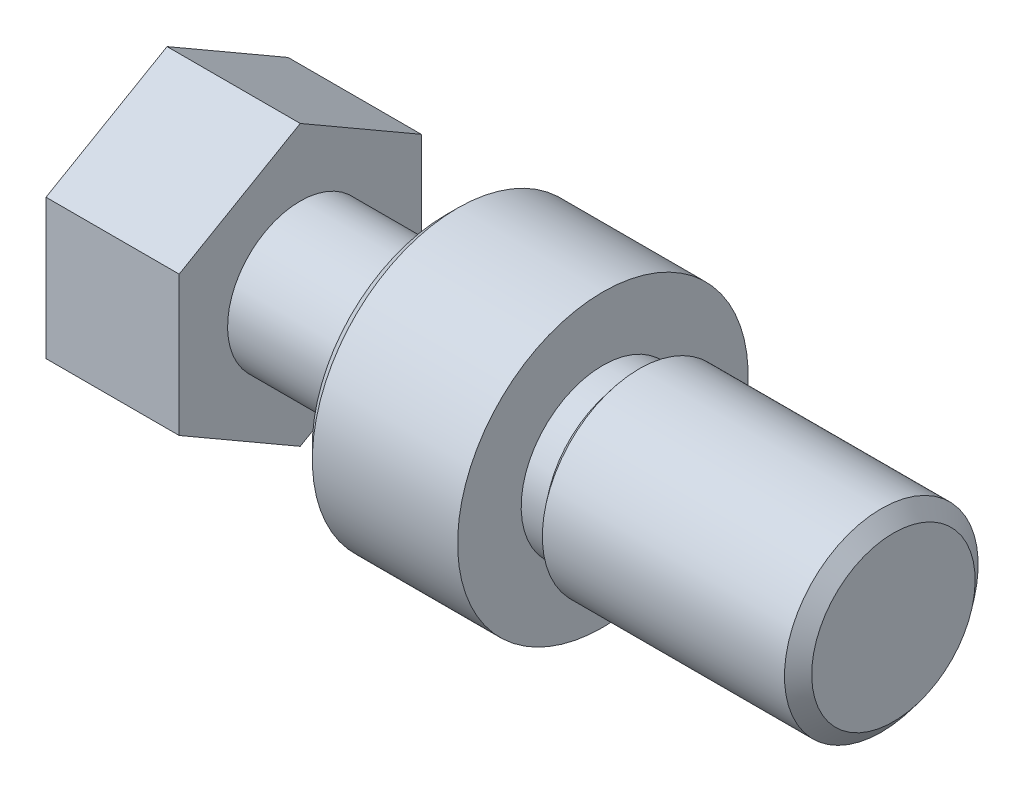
ISO-10303-21;
HEADER;
FILE_DESCRIPTION(('STEP AP214'),'2;1');
FILE_NAME('part.step','',(''),(''),'','','');
FILE_SCHEMA(('AUTOMOTIVE_DESIGN { 1 0 10303 214 1 1 1 1 }'));
ENDSEC;
DATA;
#1=APPLICATION_CONTEXT('core data for automotive mechanical design processes');
#2=APPLICATION_PROTOCOL_DEFINITION('international standard','automotive_design',2000,#1);
#3=PRODUCT_CONTEXT('',#1,'mechanical');
#4=PRODUCT('Part','Part','',(#3));
#5=PRODUCT_RELATED_PRODUCT_CATEGORY('part','',(#4));
#6=PRODUCT_DEFINITION_FORMATION('','',#4);
#7=PRODUCT_DEFINITION_CONTEXT('part definition',#1,'design');
#8=PRODUCT_DEFINITION('design','',#6,#7);
#9=PRODUCT_DEFINITION_SHAPE('','',#8);
#10=(LENGTH_UNIT() NAMED_UNIT(*) SI_UNIT(.MILLI.,.METRE.));
#11=(NAMED_UNIT(*) PLANE_ANGLE_UNIT() SI_UNIT($,.RADIAN.));
#12=(NAMED_UNIT(*) SI_UNIT($,.STERADIAN.) SOLID_ANGLE_UNIT());
#13=UNCERTAINTY_MEASURE_WITH_UNIT(LENGTH_MEASURE(1.E-05),#10,'distance_accuracy_value','');
#14=(GEOMETRIC_REPRESENTATION_CONTEXT(3) GLOBAL_UNCERTAINTY_ASSIGNED_CONTEXT((#13)) GLOBAL_UNIT_ASSIGNED_CONTEXT((#10,
#11,#12)) REPRESENTATION_CONTEXT('',''));
#15=CARTESIAN_POINT('',(0.,0.,0.));
#16=DIRECTION('',(0.,0.,1.));
#17=DIRECTION('',(1.,0.,0.));
#18=AXIS2_PLACEMENT_3D('',#15,#16,#17);
#19=CARTESIAN_POINT('',(-49.,1.6875,0.));
#20=DIRECTION('',(1.,0.,0.));
#21=DIRECTION('',(0.,0.,-1.));
#22=AXIS2_PLACEMENT_3D('',#19,#20,#21);
#23=PLANE('',#22);
#24=CARTESIAN_POINT('',(-49.,0.,0.));
#25=DIRECTION('',(1.,0.,0.));
#26=DIRECTION('',(0.,1.,0.));
#27=AXIS2_PLACEMENT_3D('',#24,#25,#26);
#28=CIRCLE('',#27,3.375);
#29=CARTESIAN_POINT('',(-49.,3.375,0.));
#30=VERTEX_POINT('',#29);
#31=EDGE_CURVE('E9',#30,#30,#28,.T.);
#32=ORIENTED_EDGE('',*,*,#31,.T.);
#33=EDGE_LOOP('',(#32));
#34=FACE_BOUND('',#33,.T.);
#35=ADVANCED_FACE('F14',(#34),#23,.T.);
#36=DIRECTION('',(0.624695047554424,-0.780868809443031,0.));
#37=VECTOR('',#36,1.);
#38=CARTESIAN_POINT('',(-399246.3,499000.,1.21002304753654E-13));
#39=LINE('',#38,#37);
#40=CARTESIAN_POINT('',(-46.3,0.,0.));
#41=DIRECTION('',(-1.,0.,0.));
#42=AXIS1_PLACEMENT('',#40,#41);
#43=SURFACE_OF_REVOLUTION('',#39,#42);
#44=CARTESIAN_POINT('',(-49.5,0.,0.));
#45=DIRECTION('',(1.,0.,0.));
#46=DIRECTION('',(0.,1.,0.));
#47=AXIS2_PLACEMENT_3D('',#44,#45,#46);
#48=CIRCLE('',#47,4.);
#49=CARTESIAN_POINT('',(-49.5,4.,0.));
#50=VERTEX_POINT('',#49);
#51=EDGE_CURVE('E388',#50,#50,#48,.T.);
#52=ORIENTED_EDGE('',*,*,#51,.T.);
#53=EDGE_LOOP('',(#52));
#54=FACE_BOUND('',#53,.T.);
#55=ORIENTED_EDGE('',*,*,#31,.F.);
#56=EDGE_LOOP('',(#55));
#57=FACE_BOUND('',#56,.T.);
#58=ADVANCED_FACE('F130',(#54,#57),#43,.F.);
#59=CARTESIAN_POINT('',(-54.5,0.,0.));
#60=DIRECTION('',(-1.,0.,0.));
#61=DIRECTION('',(0.,0.,1.));
#62=AXIS2_PLACEMENT_3D('',#59,#60,#61);
#63=CYLINDRICAL_SURFACE('',#62,4.);
#64=CARTESIAN_POINT('',(-59.5,0.,0.));
#65=DIRECTION('',(1.,0.,0.));
#66=DIRECTION('',(0.,1.,0.));
#67=AXIS2_PLACEMENT_3D('',#64,#65,#66);
#68=CIRCLE('',#67,4.);
#69=CARTESIAN_POINT('',(-59.5,4.,0.));
#70=VERTEX_POINT('',#69);
#71=EDGE_CURVE('E25',#70,#70,#68,.T.);
#72=ORIENTED_EDGE('',*,*,#71,.T.);
#73=EDGE_LOOP('',(#72));
#74=FACE_BOUND('',#73,.T.);
#75=ORIENTED_EDGE('',*,*,#51,.F.);
#76=EDGE_LOOP('',(#75));
#77=FACE_BOUND('',#76,.T.);
#78=ADVANCED_FACE('F134',(#74,#77),#63,.T.);
#79=DIRECTION('',(-0.624695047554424,-0.780868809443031,0.));
#80=VECTOR('',#79,1.);
#81=CARTESIAN_POINT('',(399137.3,499000.,1.21002304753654E-13));
#82=LINE('',#81,#80);
#83=CARTESIAN_POINT('',(-62.7000000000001,0.,0.));
#84=DIRECTION('',(1.,0.,0.));
#85=AXIS1_PLACEMENT('',#83,#84);
#86=SURFACE_OF_REVOLUTION('',#82,#85);
#87=CARTESIAN_POINT('',(-59.9999999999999,0.,0.));
#88=DIRECTION('',(1.,0.,0.));
#89=DIRECTION('',(0.,1.,0.));
#90=AXIS2_PLACEMENT_3D('',#87,#88,#89);
#91=CIRCLE('',#90,3.375);
#92=CARTESIAN_POINT('',(-59.9999999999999,3.375,0.));
#93=VERTEX_POINT('',#92);
#94=EDGE_CURVE('E368',#93,#93,#91,.T.);
#95=ORIENTED_EDGE('',*,*,#94,.T.);
#96=EDGE_LOOP('',(#95));
#97=FACE_BOUND('',#96,.T.);
#98=ORIENTED_EDGE('',*,*,#71,.F.);
#99=EDGE_LOOP('',(#98));
#100=FACE_BOUND('',#99,.T.);
#101=ADVANCED_FACE('F138',(#97,#100),#86,.F.);
#102=CARTESIAN_POINT('',(-60.5,0.,0.));
#103=DIRECTION('',(-1.,0.,0.));
#104=DIRECTION('',(0.,0.,1.));
#105=AXIS2_PLACEMENT_3D('',#102,#103,#104);
#106=CYLINDRICAL_SURFACE('',#105,3.375);
#107=CARTESIAN_POINT('',(-61.0000000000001,0.,0.));
#108=DIRECTION('',(1.,0.,0.));
#109=DIRECTION('',(0.,1.,0.));
#110=AXIS2_PLACEMENT_3D('',#107,#108,#109);
#111=CIRCLE('',#110,3.375);
#112=CARTESIAN_POINT('',(-61.0000000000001,3.375,0.));
#113=VERTEX_POINT('',#112);
#114=EDGE_CURVE('E373',#113,#113,#111,.T.);
#115=ORIENTED_EDGE('',*,*,#114,.T.);
#116=EDGE_LOOP('',(#115));
#117=FACE_BOUND('',#116,.T.);
#118=ORIENTED_EDGE('',*,*,#94,.F.);
#119=EDGE_LOOP('',(#118));
#120=FACE_BOUND('',#119,.T.);
#121=ADVANCED_FACE('F142',(#117,#120),#106,.T.);
#122=CARTESIAN_POINT('',(-61.0000000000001,4.6875,0.));
#123=DIRECTION('',(1.,0.,0.));
#124=DIRECTION('',(0.,0.,-1.));
#125=AXIS2_PLACEMENT_3D('',#122,#123,#124);
#126=PLANE('',#125);
#127=CARTESIAN_POINT('',(-61.0000000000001,0.,0.));
#128=DIRECTION('',(1.,0.,0.));
#129=DIRECTION('',(0.,1.,0.));
#130=AXIS2_PLACEMENT_3D('',#127,#128,#129);
#131=CIRCLE('',#130,6.);
#132=CARTESIAN_POINT('',(-61.0000000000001,6.00000000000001,0.));
#133=VERTEX_POINT('',#132);
#134=EDGE_CURVE('E378',#133,#133,#131,.T.);
#135=ORIENTED_EDGE('',*,*,#134,.T.);
#136=EDGE_LOOP('',(#135));
#137=FACE_BOUND('',#136,.T.);
#138=ORIENTED_EDGE('',*,*,#114,.F.);
#139=EDGE_LOOP('',(#138));
#140=FACE_BOUND('',#139,.T.);
#141=ADVANCED_FACE('F146',(#137,#140),#126,.T.);
#142=CARTESIAN_POINT('',(-63.9999999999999,0.,0.));
#143=DIRECTION('',(-1.,0.,0.));
#144=DIRECTION('',(0.,0.,1.));
#145=AXIS2_PLACEMENT_3D('',#142,#143,#144);
#146=CYLINDRICAL_SURFACE('',#145,6.);
#147=CARTESIAN_POINT('',(-67.0000000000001,0.,0.));
#148=DIRECTION('',(1.,0.,0.));
#149=DIRECTION('',(0.,1.,0.));
#150=AXIS2_PLACEMENT_3D('',#147,#148,#149);
#151=CIRCLE('',#150,6.);
#152=CARTESIAN_POINT('',(-67.0000000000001,6.00000000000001,0.));
#153=VERTEX_POINT('',#152);
#154=EDGE_CURVE('E360',#153,#153,#151,.T.);
#155=ORIENTED_EDGE('',*,*,#154,.T.);
#156=EDGE_LOOP('',(#155));
#157=FACE_BOUND('',#156,.T.);
#158=ORIENTED_EDGE('',*,*,#134,.F.);
#159=EDGE_LOOP('',(#158));
#160=FACE_BOUND('',#159,.T.);
#161=ADVANCED_FACE('F150',(#157,#160),#146,.T.);
#162=DIRECTION('',(-0.707106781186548,-0.707106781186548,0.));
#163=VECTOR('',#162,1.);
#164=CARTESIAN_POINT('',(498927.,499000.,1.21002304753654E-13));
#165=LINE('',#164,#163);
#166=CARTESIAN_POINT('',(-73.0000000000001,0.,0.));
#167=DIRECTION('',(1.,0.,0.));
#168=AXIS1_PLACEMENT('',#166,#167);
#169=SURFACE_OF_REVOLUTION('',#165,#168);
#170=CARTESIAN_POINT('',(-67.5,0.,0.));
#171=DIRECTION('',(1.,0.,0.));
#172=DIRECTION('',(0.,1.,0.));
#173=AXIS2_PLACEMENT_3D('',#170,#171,#172);
#174=CIRCLE('',#173,5.5);
#175=CARTESIAN_POINT('',(-67.5,5.50000000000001,0.));
#176=VERTEX_POINT('',#175);
#177=EDGE_CURVE('E356',#176,#176,#174,.T.);
#178=ORIENTED_EDGE('',*,*,#177,.T.);
#179=EDGE_LOOP('',(#178));
#180=FACE_BOUND('',#179,.T.);
#181=ORIENTED_EDGE('',*,*,#154,.F.);
#182=EDGE_LOOP('',(#181));
#183=FACE_BOUND('',#182,.T.);
#184=ADVANCED_FACE('F154',(#180,#183),#169,.F.);
#185=CARTESIAN_POINT('',(-67.5,4.4,0.));
#186=DIRECTION('',(-1.,0.,0.));
#187=DIRECTION('',(0.,0.,1.));
#188=AXIS2_PLACEMENT_3D('',#185,#186,#187);
#189=PLANE('',#188);
#190=CARTESIAN_POINT('',(-67.5,0.,0.));
#191=DIRECTION('',(1.,0.,0.));
#192=DIRECTION('',(0.,1.,0.));
#193=AXIS2_PLACEMENT_3D('',#190,#191,#192);
#194=CIRCLE('',#193,3.3);
#195=CARTESIAN_POINT('',(-67.5,3.3,0.));
#196=VERTEX_POINT('',#195);
#197=EDGE_CURVE('E115',#196,#196,#194,.T.);
#198=ORIENTED_EDGE('',*,*,#197,.T.);
#199=EDGE_LOOP('',(#198));
#200=FACE_BOUND('',#199,.T.);
#201=ORIENTED_EDGE('',*,*,#177,.F.);
#202=EDGE_LOOP('',(#201));
#203=FACE_BOUND('',#202,.T.);
#204=ADVANCED_FACE('F158',(#200,#203),#189,.T.);
#205=CARTESIAN_POINT('',(-67.8,0.,0.));
#206=DIRECTION('',(1.,0.,0.));
#207=DIRECTION('',(0.,0.,-1.));
#208=AXIS2_PLACEMENT_3D('',#205,#206,#207);
#209=TOROIDAL_SURFACE('',#208,3.3,0.3);
#210=CARTESIAN_POINT('',(-67.8,0.,0.));
#211=DIRECTION('',(1.,0.,0.));
#212=DIRECTION('',(0.,1.,0.));
#213=AXIS2_PLACEMENT_3D('',#210,#211,#212);
#214=CIRCLE('',#213,3.);
#215=CARTESIAN_POINT('',(-67.8,3.,0.));
#216=VERTEX_POINT('',#215);
#217=EDGE_CURVE('E366',#216,#216,#214,.T.);
#218=ORIENTED_EDGE('',*,*,#217,.T.);
#219=EDGE_LOOP('',(#218));
#220=FACE_BOUND('',#219,.T.);
#221=ORIENTED_EDGE('',*,*,#197,.F.);
#222=EDGE_LOOP('',(#221));
#223=FACE_BOUND('',#222,.T.);
#224=ADVANCED_FACE('F163',(#220,#223),#209,.F.);
#225=CARTESIAN_POINT('',(-70.65,0.,0.));
#226=DIRECTION('',(-1.,0.,0.));
#227=DIRECTION('',(0.,0.,1.));
#228=AXIS2_PLACEMENT_3D('',#225,#226,#227);
#229=CYLINDRICAL_SURFACE('',#228,3.);
#230=CARTESIAN_POINT('',(-73.5,0.,0.));
#231=DIRECTION('',(1.,0.,0.));
#232=DIRECTION('',(0.,1.,0.));
#233=AXIS2_PLACEMENT_3D('',#230,#231,#232);
#234=CIRCLE('',#233,3.);
#235=CARTESIAN_POINT('',(-73.5,3.,0.));
#236=VERTEX_POINT('',#235);
#237=EDGE_CURVE('E362',#236,#236,#234,.T.);
#238=ORIENTED_EDGE('',*,*,#237,.T.);
#239=EDGE_LOOP('',(#238));
#240=FACE_BOUND('',#239,.T.);
#241=ORIENTED_EDGE('',*,*,#217,.F.);
#242=EDGE_LOOP('',(#241));
#243=FACE_BOUND('',#242,.T.);
#244=ADVANCED_FACE('F167',(#240,#243),#229,.T.);
#245=CARTESIAN_POINT('',(-79.0000000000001,0.,0.));
#246=DIRECTION('',(-1.,0.,0.));
#247=DIRECTION('',(0.,0.,1.));
#248=AXIS2_PLACEMENT_3D('',#245,#246,#247);
#249=PLANE('',#248);
#250=DIRECTION('',(0.,-1.,0.));
#251=VECTOR('',#250,1.);
#252=CARTESIAN_POINT('',(-79.0000000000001,2.88675134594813,5.00000000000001));
#253=LINE('',#252,#251);
#254=CARTESIAN_POINT('',(-79.0000000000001,2.88675134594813,5.00000000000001));
#255=VERTEX_POINT('',#254);
#256=CARTESIAN_POINT('',(-79.0000000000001,-2.88675134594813,5.));
#257=VERTEX_POINT('',#256);
#258=EDGE_CURVE('E116',#255,#257,#253,.T.);
#259=ORIENTED_EDGE('',*,*,#258,.F.);
#260=DIRECTION('',(0.,-0.500194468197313,0.86591309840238));
#261=VECTOR('',#260,1.);
#262=CARTESIAN_POINT('',(-79.0000000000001,5.775,0.));
#263=LINE('',#262,#261);
#264=CARTESIAN_POINT('',(-79.0000000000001,5.775,0.));
#265=VERTEX_POINT('',#264);
#266=EDGE_CURVE('E34',#265,#255,#263,.T.);
#267=ORIENTED_EDGE('',*,*,#266,.F.);
#268=DIRECTION('',(0.,0.500194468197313,0.86591309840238));
#269=VECTOR('',#268,1.);
#270=CARTESIAN_POINT('',(-79.0000000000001,2.88675134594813,-5.));
#271=LINE('',#270,#269);
#272=CARTESIAN_POINT('',(-79.0000000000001,2.88675134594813,-5.));
#273=VERTEX_POINT('',#272);
#274=EDGE_CURVE('E70',#273,#265,#271,.T.);
#275=ORIENTED_EDGE('',*,*,#274,.F.);
#276=DIRECTION('',(0.,1.,0.));
#277=VECTOR('',#276,1.);
#278=CARTESIAN_POINT('',(-79.0000000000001,-2.88675134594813,-5.));
#279=LINE('',#278,#277);
#280=CARTESIAN_POINT('',(-79.0000000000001,-2.88675134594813,-5.));
#281=VERTEX_POINT('',#280);
#282=EDGE_CURVE('E73',#281,#273,#279,.T.);
#283=ORIENTED_EDGE('',*,*,#282,.F.);
#284=DIRECTION('',(0.,0.500194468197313,-0.86591309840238));
#285=VECTOR('',#284,1.);
#286=CARTESIAN_POINT('',(-79.0000000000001,-5.77500000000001,0.));
#287=LINE('',#286,#285);
#288=CARTESIAN_POINT('',(-79.0000000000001,-5.77500000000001,0.));
#289=VERTEX_POINT('',#288);
#290=EDGE_CURVE('E111',#289,#281,#287,.T.);
#291=ORIENTED_EDGE('',*,*,#290,.F.);
#292=DIRECTION('',(0.,-0.500194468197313,-0.86591309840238));
#293=VECTOR('',#292,1.);
#294=CARTESIAN_POINT('',(-79.0000000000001,-2.88675134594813,5.));
#295=LINE('',#294,#293);
#296=EDGE_CURVE('E51',#257,#289,#295,.T.);
#297=ORIENTED_EDGE('',*,*,#296,.F.);
#298=EDGE_LOOP('',(#259,#267,#275,#283,#291,#297));
#299=FACE_BOUND('',#298,.T.);
#300=ADVANCED_FACE('F72',(#299),#249,.T.);
#301=CARTESIAN_POINT('',(-79.0000000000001,-2.88675134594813,5.));
#302=DIRECTION('',(0.,0.,1.));
#303=DIRECTION('',(1.,0.,0.));
#304=AXIS2_PLACEMENT_3D('',#301,#302,#303);
#305=PLANE('',#304);
#306=DIRECTION('',(0.,1.,0.));
#307=VECTOR('',#306,1.);
#308=CARTESIAN_POINT('',(-73.5,2.88675134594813,5.00000000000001));
#309=LINE('',#308,#307);
#310=CARTESIAN_POINT('',(-73.5,-2.88675134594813,5.));
#311=VERTEX_POINT('',#310);
#312=CARTESIAN_POINT('',(-73.5,2.88675134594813,5.00000000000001));
#313=VERTEX_POINT('',#312);
#314=EDGE_CURVE('E112',#311,#313,#309,.T.);
#315=ORIENTED_EDGE('',*,*,#314,.T.);
#316=DIRECTION('',(1.,0.,0.));
#317=VECTOR('',#316,1.);
#318=CARTESIAN_POINT('',(-79.0000000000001,2.88675134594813,5.00000000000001));
#319=LINE('',#318,#317);
#320=EDGE_CURVE('E58',#255,#313,#319,.T.);
#321=ORIENTED_EDGE('',*,*,#320,.F.);
#322=ORIENTED_EDGE('',*,*,#258,.T.);
#323=DIRECTION('',(1.,0.,0.));
#324=VECTOR('',#323,1.);
#325=CARTESIAN_POINT('',(-79.0000000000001,-2.88675134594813,5.));
#326=LINE('',#325,#324);
#327=EDGE_CURVE('E105',#257,#311,#326,.T.);
#328=ORIENTED_EDGE('',*,*,#327,.T.);
#329=EDGE_LOOP('',(#315,#321,#322,#328));
#330=FACE_BOUND('',#329,.T.);
#331=ADVANCED_FACE('F174',(#330),#305,.T.);
#332=CARTESIAN_POINT('',(-79.0000000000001,-5.77500000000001,0.));
#333=DIRECTION('',(0.,-0.86591309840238,0.500194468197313));
#334=DIRECTION('',(0.,-0.500194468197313,-0.86591309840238));
#335=AXIS2_PLACEMENT_3D('',#332,#333,#334);
#336=PLANE('',#335);
#337=DIRECTION('',(0.,0.500194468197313,0.86591309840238));
#338=VECTOR('',#337,1.);
#339=CARTESIAN_POINT('',(-73.5,-2.88675134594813,5.));
#340=LINE('',#339,#338);
#341=CARTESIAN_POINT('',(-73.5,-5.77500000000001,0.));
#342=VERTEX_POINT('',#341);
#343=EDGE_CURVE('E122',#342,#311,#340,.T.);
#344=ORIENTED_EDGE('',*,*,#343,.T.);
#345=ORIENTED_EDGE('',*,*,#327,.F.);
#346=ORIENTED_EDGE('',*,*,#296,.T.);
#347=DIRECTION('',(1.,0.,0.));
#348=VECTOR('',#347,1.);
#349=CARTESIAN_POINT('',(-79.0000000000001,-5.77500000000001,0.));
#350=LINE('',#349,#348);
#351=EDGE_CURVE('E110',#289,#342,#350,.T.);
#352=ORIENTED_EDGE('',*,*,#351,.T.);
#353=EDGE_LOOP('',(#344,#345,#346,#352));
#354=FACE_BOUND('',#353,.T.);
#355=ADVANCED_FACE('F177',(#354),#336,.T.);
#356=CARTESIAN_POINT('',(-79.0000000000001,-2.88675134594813,-5.));
#357=DIRECTION('',(0.,-0.86591309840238,-0.500194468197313));
#358=DIRECTION('',(0.,0.500194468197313,-0.86591309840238));
#359=AXIS2_PLACEMENT_3D('',#356,#357,#358);
#360=PLANE('',#359);
#361=DIRECTION('',(0.,-0.500194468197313,0.86591309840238));
#362=VECTOR('',#361,1.);
#363=CARTESIAN_POINT('',(-73.5,-5.77500000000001,0.));
#364=LINE('',#363,#362);
#365=CARTESIAN_POINT('',(-73.5,-2.88675134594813,-5.));
#366=VERTEX_POINT('',#365);
#367=EDGE_CURVE('E107',#366,#342,#364,.T.);
#368=ORIENTED_EDGE('',*,*,#367,.T.);
#369=ORIENTED_EDGE('',*,*,#351,.F.);
#370=ORIENTED_EDGE('',*,*,#290,.T.);
#371=DIRECTION('',(1.,0.,0.));
#372=VECTOR('',#371,1.);
#373=CARTESIAN_POINT('',(-79.0000000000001,-2.88675134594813,-5.));
#374=LINE('',#373,#372);
#375=EDGE_CURVE('E88',#281,#366,#374,.T.);
#376=ORIENTED_EDGE('',*,*,#375,.T.);
#377=EDGE_LOOP('',(#368,#369,#370,#376));
#378=FACE_BOUND('',#377,.T.);
#379=ADVANCED_FACE('F181',(#378),#360,.T.);
#380=CARTESIAN_POINT('',(-79.0000000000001,2.88675134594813,-5.));
#381=DIRECTION('',(0.,0.,-1.));
#382=DIRECTION('',(-1.,0.,0.));
#383=AXIS2_PLACEMENT_3D('',#380,#381,#382);
#384=PLANE('',#383);
#385=DIRECTION('',(0.,-1.,0.));
#386=VECTOR('',#385,1.);
#387=CARTESIAN_POINT('',(-73.5,-2.88675134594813,-5.));
#388=LINE('',#387,#386);
#389=CARTESIAN_POINT('',(-73.5,2.88675134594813,-5.));
#390=VERTEX_POINT('',#389);
#391=EDGE_CURVE('E91',#390,#366,#388,.T.);
#392=ORIENTED_EDGE('',*,*,#391,.T.);
#393=ORIENTED_EDGE('',*,*,#375,.F.);
#394=ORIENTED_EDGE('',*,*,#282,.T.);
#395=DIRECTION('',(1.,0.,0.));
#396=VECTOR('',#395,1.);
#397=CARTESIAN_POINT('',(-79.0000000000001,2.88675134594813,-5.));
#398=LINE('',#397,#396);
#399=EDGE_CURVE('E85',#273,#390,#398,.T.);
#400=ORIENTED_EDGE('',*,*,#399,.T.);
#401=EDGE_LOOP('',(#392,#393,#394,#400));
#402=FACE_BOUND('',#401,.T.);
#403=ADVANCED_FACE('F84',(#402),#384,.T.);
#404=CARTESIAN_POINT('',(-79.0000000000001,5.775,0.));
#405=DIRECTION('',(0.,0.86591309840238,-0.500194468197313));
#406=DIRECTION('',(0.,0.500194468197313,0.86591309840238));
#407=AXIS2_PLACEMENT_3D('',#404,#405,#406);
#408=PLANE('',#407);
#409=DIRECTION('',(0.,-0.500194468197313,-0.86591309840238));
#410=VECTOR('',#409,1.);
#411=CARTESIAN_POINT('',(-73.5,2.88675134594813,-5.));
#412=LINE('',#411,#410);
#413=CARTESIAN_POINT('',(-73.5,5.775,0.));
#414=VERTEX_POINT('',#413);
#415=EDGE_CURVE('E79',#414,#390,#412,.T.);
#416=ORIENTED_EDGE('',*,*,#415,.T.);
#417=ORIENTED_EDGE('',*,*,#399,.F.);
#418=ORIENTED_EDGE('',*,*,#274,.T.);
#419=DIRECTION('',(1.,0.,0.));
#420=VECTOR('',#419,1.);
#421=CARTESIAN_POINT('',(-79.0000000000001,5.775,0.));
#422=LINE('',#421,#420);
#423=EDGE_CURVE('E80',#265,#414,#422,.T.);
#424=ORIENTED_EDGE('',*,*,#423,.T.);
#425=EDGE_LOOP('',(#416,#417,#418,#424));
#426=FACE_BOUND('',#425,.T.);
#427=ADVANCED_FACE('F94',(#426),#408,.T.);
#428=CARTESIAN_POINT('',(-79.0000000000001,2.88675134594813,5.00000000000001));
#429=DIRECTION('',(0.,0.86591309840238,0.500194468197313));
#430=DIRECTION('',(0.,-0.500194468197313,0.86591309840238));
#431=AXIS2_PLACEMENT_3D('',#428,#429,#430);
#432=PLANE('',#431);
#433=DIRECTION('',(0.,0.500194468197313,-0.86591309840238));
#434=VECTOR('',#433,1.);
#435=CARTESIAN_POINT('',(-73.5,5.775,0.));
#436=LINE('',#435,#434);
#437=EDGE_CURVE('E341',#313,#414,#436,.T.);
#438=ORIENTED_EDGE('',*,*,#437,.T.);
#439=ORIENTED_EDGE('',*,*,#423,.F.);
#440=ORIENTED_EDGE('',*,*,#266,.T.);
#441=ORIENTED_EDGE('',*,*,#320,.T.);
#442=EDGE_LOOP('',(#438,#439,#440,#441));
#443=FACE_BOUND('',#442,.T.);
#444=ADVANCED_FACE('F189',(#443),#432,.T.);
#445=CARTESIAN_POINT('',(-73.5,0.,0.));
#446=DIRECTION('',(1.,0.,0.));
#447=DIRECTION('',(0.,0.,-1.));
#448=AXIS2_PLACEMENT_3D('',#445,#446,#447);
#449=PLANE('',#448);
#450=ORIENTED_EDGE('',*,*,#237,.F.);
#451=EDGE_LOOP('',(#450));
#452=FACE_BOUND('',#451,.T.);
#453=ORIENTED_EDGE('',*,*,#437,.F.);
#454=ORIENTED_EDGE('',*,*,#314,.F.);
#455=ORIENTED_EDGE('',*,*,#343,.F.);
#456=ORIENTED_EDGE('',*,*,#367,.F.);
#457=ORIENTED_EDGE('',*,*,#391,.F.);
#458=ORIENTED_EDGE('',*,*,#415,.F.);
#459=EDGE_LOOP('',(#453,#454,#455,#456,#457,#458));
#460=FACE_BOUND('',#459,.T.);
#461=ADVANCED_FACE('F16',(#452,#460),#449,.T.);
#462=CLOSED_SHELL('',(#35,#58,#78,#101,#121,#141,#161,#184,#204,#224,#244,#300,#331,#355,#379,
#403,#427,#444,#461));
#463=MANIFOLD_SOLID_BREP('B1',#462);
#464=ADVANCED_BREP_SHAPE_REPRESENTATION('',(#18,#463),#14);
#465=SHAPE_DEFINITION_REPRESENTATION(#9,#464);
ENDSEC;
END-ISO-10303-21;
